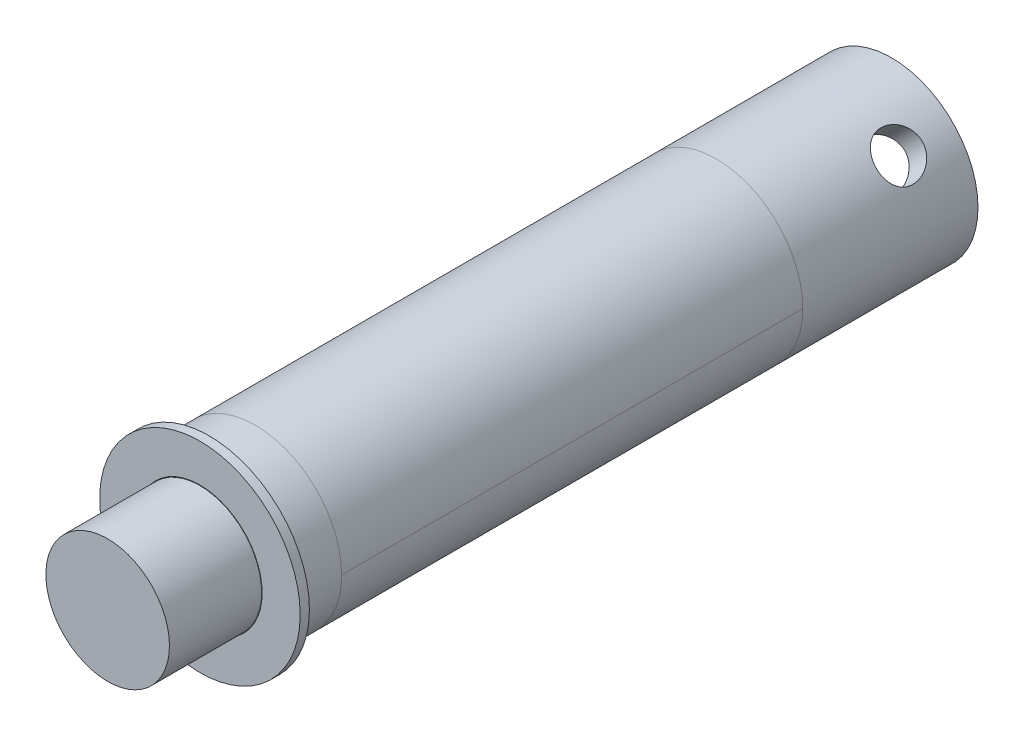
from build123d import *

# Parameters (mm, degrees)
SKETCH1_R           = 23.8125
SKETCH1_R_2         = 17.145
BOSS_EXTRUDE1_DEPTH = 190.5
SKETCH2_R           = 27.6225
SKETCH2_R_2         = 21.2725
BOSS_EXTRUDE2_DEPTH = 2.54
SKETCH3_R           = 17.018
BOSS_EXTRUDE3_DEPTH = 25.4
SKETCH7_W           = 6.35
SKETCH7_H           = 62.873747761


with BuildPart() as part:
    # Sketch1 → Boss-Extrude1 (new body)
    with BuildSketch(Plane.XY):
        Circle(SKETCH1_R)
        Circle(SKETCH1_R_2, mode=Mode.SUBTRACT)
    extrude(amount=BOSS_EXTRUDE1_DEPTH)

    # Sketch2 → Boss-Extrude2 (add)
    with BuildSketch(Plane.XY.offset(190.5)):
        Circle(SKETCH2_R)
        Circle(SKETCH2_R_2, mode=Mode.SUBTRACT)
    extrude(amount=-BOSS_EXTRUDE2_DEPTH)

    # Sketch7 → 1_2 _0.5_ Diameter Slot1 (revolve, cut)
    with BuildSketch(Plane(origin=(17.04071827, 16.632771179, 14.921775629), x_dir=(-0.6984890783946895, 0.7156207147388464, 0), z_dir=(0, 0, 1))):
        with Locations((3.175, 31.436873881)):
            Rectangle(SKETCH7_W, SKETCH7_H)
    revolve(axis=Axis((21.584909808, 21.068176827, 14.921775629), (-0.7156207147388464, -0.6984890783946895, 0)), mode=Mode.SUBTRACT)


with BuildPart() as body_2:
    # Sketch3 → Boss-Extrude3 (new body)
    with BuildSketch(Plane.XY.offset(190.5)):
        Circle(SKETCH3_R)
    extrude(amount=BOSS_EXTRUDE3_DEPTH)


solid = Compound([part.part, body_2.part])
